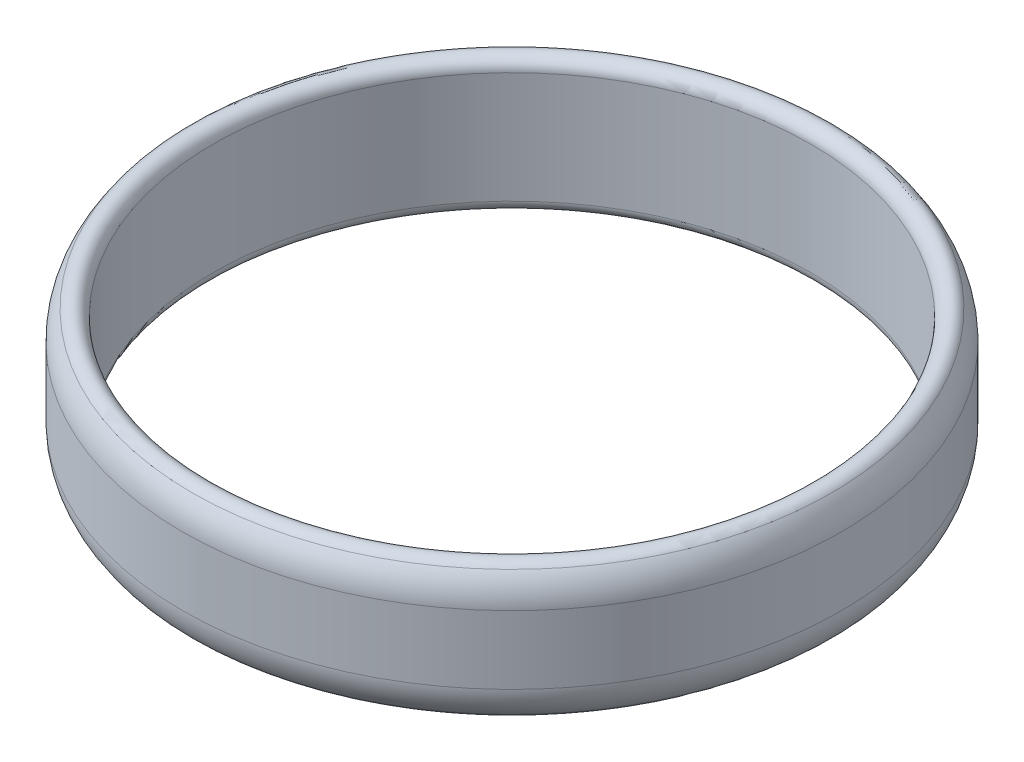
ISO-10303-21;
HEADER;
FILE_DESCRIPTION(('STEP AP214'),'2;1');
FILE_NAME('part.step','',(''),(''),'','','');
FILE_SCHEMA(('AUTOMOTIVE_DESIGN { 1 0 10303 214 1 1 1 1 }'));
ENDSEC;
DATA;
#1=APPLICATION_CONTEXT('core data for automotive mechanical design processes');
#2=APPLICATION_PROTOCOL_DEFINITION('international standard','automotive_design',2000,#1);
#3=PRODUCT_CONTEXT('',#1,'mechanical');
#4=PRODUCT('Part','Part','',(#3));
#5=PRODUCT_RELATED_PRODUCT_CATEGORY('part','',(#4));
#6=PRODUCT_DEFINITION_FORMATION('','',#4);
#7=PRODUCT_DEFINITION_CONTEXT('part definition',#1,'design');
#8=PRODUCT_DEFINITION('design','',#6,#7);
#9=PRODUCT_DEFINITION_SHAPE('','',#8);
#10=(LENGTH_UNIT() NAMED_UNIT(*) SI_UNIT(.MILLI.,.METRE.));
#11=(NAMED_UNIT(*) PLANE_ANGLE_UNIT() SI_UNIT($,.RADIAN.));
#12=(NAMED_UNIT(*) SI_UNIT($,.STERADIAN.) SOLID_ANGLE_UNIT());
#13=UNCERTAINTY_MEASURE_WITH_UNIT(LENGTH_MEASURE(1.E-05),#10,'distance_accuracy_value','');
#14=(GEOMETRIC_REPRESENTATION_CONTEXT(3) GLOBAL_UNCERTAINTY_ASSIGNED_CONTEXT((#13)) GLOBAL_UNIT_ASSIGNED_CONTEXT((#10,
#11,#12)) REPRESENTATION_CONTEXT('',''));
#15=CARTESIAN_POINT('',(0.,0.,0.));
#16=DIRECTION('',(0.,0.,1.));
#17=DIRECTION('',(1.,0.,0.));
#18=AXIS2_PLACEMENT_3D('',#15,#16,#17);
#19=CARTESIAN_POINT('',(0.,0.,0.));
#20=DIRECTION('',(0.,-1.,0.));
#21=DIRECTION('',(0.,0.,-1.));
#22=AXIS2_PLACEMENT_3D('',#19,#20,#21);
#23=CYLINDRICAL_SURFACE('',#22,64.5905314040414);
#24=CARTESIAN_POINT('',(0.,28.7992816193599,0.));
#25=DIRECTION('',(0.,1.,0.));
#26=DIRECTION('',(0.,0.,1.));
#27=AXIS2_PLACEMENT_3D('',#24,#25,#26);
#28=CIRCLE('',#27,64.5905314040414);
#29=CARTESIAN_POINT('',(0.,28.7992816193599,64.5905314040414));
#30=VERTEX_POINT('',#29);
#31=EDGE_CURVE('E37',#30,#30,#28,.T.);
#32=ORIENTED_EDGE('',*,*,#31,.T.);
#33=EDGE_LOOP('',(#32));
#34=FACE_BOUND('',#33,.T.);
#35=CARTESIAN_POINT('',(0.,4.76055773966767,0.));
#36=DIRECTION('',(0.,1.,0.));
#37=DIRECTION('',(0.,0.,1.));
#38=AXIS2_PLACEMENT_3D('',#35,#36,#37);
#39=CIRCLE('',#38,64.5905314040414);
#40=CARTESIAN_POINT('',(0.,4.76055773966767,64.5905314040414));
#41=VERTEX_POINT('',#40);
#42=EDGE_CURVE('E41',#41,#41,#39,.F.);
#43=ORIENTED_EDGE('',*,*,#42,.T.);
#44=EDGE_LOOP('',(#43));
#45=FACE_BOUND('',#44,.T.);
#46=ADVANCED_FACE('F30',(#34,#45),#23,.F.);
#47=CARTESIAN_POINT('',(0.,0.,0.));
#48=DIRECTION('',(0.,-1.,0.));
#49=DIRECTION('',(0.,0.,-1.));
#50=AXIS2_PLACEMENT_3D('',#47,#48,#49);
#51=CYLINDRICAL_SURFACE('',#50,71.2052243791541);
#52=CARTESIAN_POINT('',(0.,9.4095534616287,0.));
#53=DIRECTION('',(0.,-1.,0.));
#54=DIRECTION('',(0.,0.,-1.));
#55=AXIS2_PLACEMENT_3D('',#52,#53,#54);
#56=CIRCLE('',#55,71.2052243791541);
#57=CARTESIAN_POINT('',(0.,9.4095534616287,-71.2052243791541));
#58=VERTEX_POINT('',#57);
#59=EDGE_CURVE('E50',#58,#58,#56,.F.);
#60=ORIENTED_EDGE('',*,*,#59,.T.);
#61=EDGE_LOOP('',(#60));
#62=FACE_BOUND('',#61,.T.);
#63=CARTESIAN_POINT('',(0.,24.1502858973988,0.));
#64=DIRECTION('',(0.,1.,0.));
#65=DIRECTION('',(0.,0.,1.));
#66=AXIS2_PLACEMENT_3D('',#63,#64,#65);
#67=CIRCLE('',#66,71.2052243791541);
#68=CARTESIAN_POINT('',(0.,24.1502858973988,71.2052243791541));
#69=VERTEX_POINT('',#68);
#70=EDGE_CURVE('E53',#69,#69,#67,.F.);
#71=ORIENTED_EDGE('',*,*,#70,.T.);
#72=EDGE_LOOP('',(#71));
#73=FACE_BOUND('',#72,.T.);
#74=ADVANCED_FACE('F57',(#62,#73),#51,.T.);
#75=CARTESIAN_POINT('',(0.,9.4095534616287,0.));
#76=DIRECTION('',(0.,-1.,0.));
#77=DIRECTION('',(0.,0.,-1.));
#78=AXIS2_PLACEMENT_3D('',#75,#76,#77);
#79=TOROIDAL_SURFACE('',#78,61.2052243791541,10.);
#80=CARTESIAN_POINT('',(0.,3.21089249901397,0.));
#81=DIRECTION('',(0.,1.,0.));
#82=DIRECTION('',(0.,0.,1.));
#83=AXIS2_PLACEMENT_3D('',#80,#81,#82);
#84=CIRCLE('',#83,69.0523004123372);
#85=CARTESIAN_POINT('',(0.,3.21089249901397,69.0523004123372));
#86=VERTEX_POINT('',#85);
#87=EDGE_CURVE('E10',#86,#86,#84,.T.);
#88=ORIENTED_EDGE('',*,*,#87,.T.);
#89=EDGE_LOOP('',(#88));
#90=FACE_BOUND('',#89,.T.);
#91=ORIENTED_EDGE('',*,*,#59,.F.);
#92=EDGE_LOOP('',(#91));
#93=FACE_BOUND('',#92,.T.);
#94=ADVANCED_FACE('F62',(#90,#93),#79,.T.);
#95=CARTESIAN_POINT('',(0.,24.1502858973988,0.));
#96=DIRECTION('',(0.,1.,0.));
#97=DIRECTION('',(0.,0.,1.));
#98=AXIS2_PLACEMENT_3D('',#95,#96,#97);
#99=TOROIDAL_SURFACE('',#98,61.2052243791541,10.);
#100=CARTESIAN_POINT('',(0.,30.3489468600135,0.));
#101=DIRECTION('',(0.,-1.,0.));
#102=DIRECTION('',(0.,0.,-1.));
#103=AXIS2_PLACEMENT_3D('',#100,#101,#102);
#104=CIRCLE('',#103,69.0523004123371);
#105=CARTESIAN_POINT('',(0.,30.3489468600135,-69.0523004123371));
#106=VERTEX_POINT('',#105);
#107=EDGE_CURVE('E45',#106,#106,#104,.T.);
#108=ORIENTED_EDGE('',*,*,#107,.T.);
#109=EDGE_LOOP('',(#108));
#110=FACE_BOUND('',#109,.T.);
#111=ORIENTED_EDGE('',*,*,#70,.F.);
#112=EDGE_LOOP('',(#111));
#113=FACE_BOUND('',#112,.T.);
#114=ADVANCED_FACE('F59',(#110,#113),#99,.T.);
#115=CARTESIAN_POINT('',(0.,28.7992816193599,0.));
#116=DIRECTION('',(0.,1.,0.));
#117=DIRECTION('',(0.,0.,1.));
#118=AXIS2_PLACEMENT_3D('',#115,#116,#117);
#119=TOROIDAL_SURFACE('',#118,67.0905314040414,2.5);
#120=ORIENTED_EDGE('',*,*,#31,.F.);
#121=EDGE_LOOP('',(#120));
#122=FACE_BOUND('',#121,.T.);
#123=ORIENTED_EDGE('',*,*,#107,.F.);
#124=EDGE_LOOP('',(#123));
#125=FACE_BOUND('',#124,.T.);
#126=ADVANCED_FACE('F61',(#122,#125),#119,.T.);
#127=CARTESIAN_POINT('',(0.,4.76055773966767,0.));
#128=DIRECTION('',(0.,1.,0.));
#129=DIRECTION('',(0.,0.,1.));
#130=AXIS2_PLACEMENT_3D('',#127,#128,#129);
#131=TOROIDAL_SURFACE('',#130,67.0905314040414,2.5);
#132=ORIENTED_EDGE('',*,*,#87,.F.);
#133=EDGE_LOOP('',(#132));
#134=FACE_BOUND('',#133,.T.);
#135=ORIENTED_EDGE('',*,*,#42,.F.);
#136=EDGE_LOOP('',(#135));
#137=FACE_BOUND('',#136,.T.);
#138=ADVANCED_FACE('F32',(#134,#137),#131,.T.);
#139=CLOSED_SHELL('',(#46,#74,#94,#114,#126,#138));
#140=MANIFOLD_SOLID_BREP('B2',#139);
#141=ADVANCED_BREP_SHAPE_REPRESENTATION('',(#18,#140),#14);
#142=SHAPE_DEFINITION_REPRESENTATION(#9,#141);
ENDSEC;
END-ISO-10303-21;
